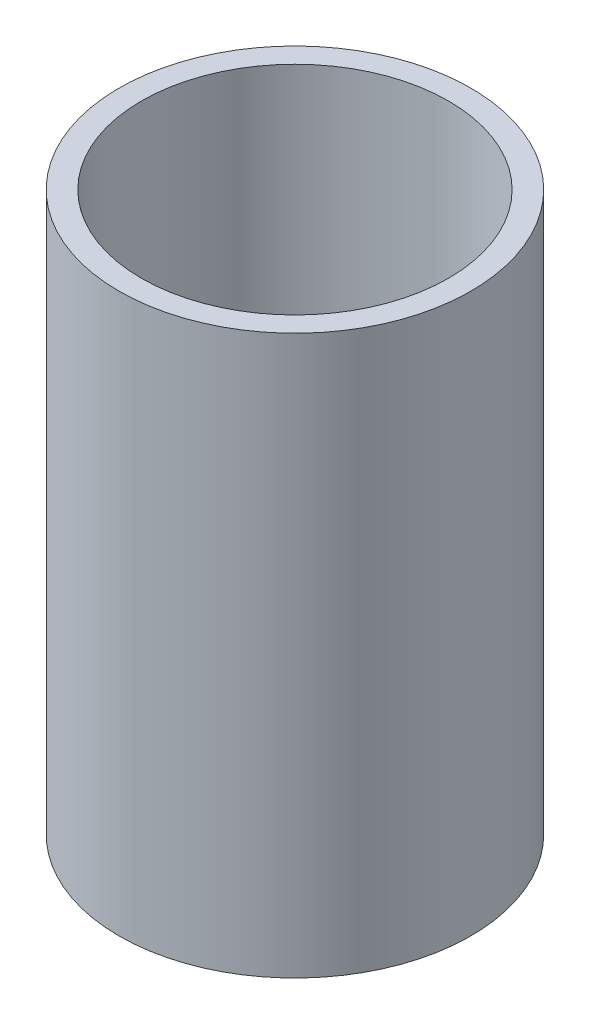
ISO-10303-21;
HEADER;
FILE_DESCRIPTION(('STEP AP214'),'2;1');
FILE_NAME('part.step','',(''),(''),'','','');
FILE_SCHEMA(('AUTOMOTIVE_DESIGN { 1 0 10303 214 1 1 1 1 }'));
ENDSEC;
DATA;
#1=APPLICATION_CONTEXT('core data for automotive mechanical design processes');
#2=APPLICATION_PROTOCOL_DEFINITION('international standard','automotive_design',2000,#1);
#3=PRODUCT_CONTEXT('',#1,'mechanical');
#4=PRODUCT('Part','Part','',(#3));
#5=PRODUCT_RELATED_PRODUCT_CATEGORY('part','',(#4));
#6=PRODUCT_DEFINITION_FORMATION('','',#4);
#7=PRODUCT_DEFINITION_CONTEXT('part definition',#1,'design');
#8=PRODUCT_DEFINITION('design','',#6,#7);
#9=PRODUCT_DEFINITION_SHAPE('','',#8);
#10=(LENGTH_UNIT() NAMED_UNIT(*) SI_UNIT(.MILLI.,.METRE.));
#11=(NAMED_UNIT(*) PLANE_ANGLE_UNIT() SI_UNIT($,.RADIAN.));
#12=(NAMED_UNIT(*) SI_UNIT($,.STERADIAN.) SOLID_ANGLE_UNIT());
#13=UNCERTAINTY_MEASURE_WITH_UNIT(LENGTH_MEASURE(1.E-05),#10,'distance_accuracy_value','');
#14=(GEOMETRIC_REPRESENTATION_CONTEXT(3) GLOBAL_UNCERTAINTY_ASSIGNED_CONTEXT((#13)) GLOBAL_UNIT_ASSIGNED_CONTEXT((#10,
#11,#12)) REPRESENTATION_CONTEXT('',''));
#15=CARTESIAN_POINT('',(0.,0.,0.));
#16=DIRECTION('',(0.,0.,1.));
#17=DIRECTION('',(1.,0.,0.));
#18=AXIS2_PLACEMENT_3D('',#15,#16,#17);
#19=CARTESIAN_POINT('',(0.,100.,0.));
#20=DIRECTION('',(0.,1.,0.));
#21=DIRECTION('',(0.,0.,1.));
#22=AXIS2_PLACEMENT_3D('',#19,#20,#21);
#23=PLANE('',#22);
#24=CARTESIAN_POINT('',(0.,100.,0.));
#25=DIRECTION('',(0.,1.,0.));
#26=DIRECTION('',(0.,0.,1.));
#27=AXIS2_PLACEMENT_3D('',#24,#25,#26);
#28=CIRCLE('',#27,31.5);
#29=CARTESIAN_POINT('',(0.,100.,31.5));
#30=VERTEX_POINT('',#29);
#31=EDGE_CURVE('E10',#30,#30,#28,.T.);
#32=ORIENTED_EDGE('',*,*,#31,.T.);
#33=EDGE_LOOP('',(#32));
#34=FACE_BOUND('',#33,.T.);
#35=CARTESIAN_POINT('',(0.,100.,0.));
#36=DIRECTION('',(0.,1.,0.));
#37=DIRECTION('',(0.,0.,1.));
#38=AXIS2_PLACEMENT_3D('',#35,#36,#37);
#39=CIRCLE('',#38,27.5);
#40=CARTESIAN_POINT('',(0.,100.,27.5));
#41=VERTEX_POINT('',#40);
#42=EDGE_CURVE('E42',#41,#41,#39,.T.);
#43=ORIENTED_EDGE('',*,*,#42,.F.);
#44=EDGE_LOOP('',(#43));
#45=FACE_BOUND('',#44,.T.);
#46=ADVANCED_FACE('F31',(#34,#45),#23,.T.);
#47=CARTESIAN_POINT('',(0.,0.,0.));
#48=DIRECTION('',(0.,1.,0.));
#49=DIRECTION('',(0.,0.,1.));
#50=AXIS2_PLACEMENT_3D('',#47,#48,#49);
#51=PLANE('',#50);
#52=CARTESIAN_POINT('',(0.,0.,0.));
#53=DIRECTION('',(0.,1.,0.));
#54=DIRECTION('',(0.,0.,1.));
#55=AXIS2_PLACEMENT_3D('',#52,#53,#54);
#56=CIRCLE('',#55,31.5);
#57=CARTESIAN_POINT('',(0.,0.,31.5));
#58=VERTEX_POINT('',#57);
#59=EDGE_CURVE('E35',#58,#58,#56,.T.);
#60=ORIENTED_EDGE('',*,*,#59,.F.);
#61=EDGE_LOOP('',(#60));
#62=FACE_BOUND('',#61,.T.);
#63=CARTESIAN_POINT('',(0.,0.,0.));
#64=DIRECTION('',(0.,1.,0.));
#65=DIRECTION('',(0.,0.,1.));
#66=AXIS2_PLACEMENT_3D('',#63,#64,#65);
#67=CIRCLE('',#66,27.5);
#68=CARTESIAN_POINT('',(0.,0.,27.5));
#69=VERTEX_POINT('',#68);
#70=EDGE_CURVE('E44',#69,#69,#67,.T.);
#71=ORIENTED_EDGE('',*,*,#70,.T.);
#72=EDGE_LOOP('',(#71));
#73=FACE_BOUND('',#72,.T.);
#74=ADVANCED_FACE('F54',(#62,#73),#51,.F.);
#75=CARTESIAN_POINT('',(0.,100.,0.));
#76=DIRECTION('',(0.,-1.,0.));
#77=DIRECTION('',(0.,0.,-1.));
#78=AXIS2_PLACEMENT_3D('',#75,#76,#77);
#79=CYLINDRICAL_SURFACE('',#78,31.5);
#80=ORIENTED_EDGE('',*,*,#31,.F.);
#81=EDGE_LOOP('',(#80));
#82=FACE_BOUND('',#81,.T.);
#83=ORIENTED_EDGE('',*,*,#59,.T.);
#84=EDGE_LOOP('',(#83));
#85=FACE_BOUND('',#84,.T.);
#86=ADVANCED_FACE('F33',(#82,#85),#79,.T.);
#87=CARTESIAN_POINT('',(0.,100.,0.));
#88=DIRECTION('',(0.,-1.,0.));
#89=DIRECTION('',(0.,0.,-1.));
#90=AXIS2_PLACEMENT_3D('',#87,#88,#89);
#91=CYLINDRICAL_SURFACE('',#90,27.5);
#92=ORIENTED_EDGE('',*,*,#42,.T.);
#93=EDGE_LOOP('',(#92));
#94=FACE_BOUND('',#93,.T.);
#95=ORIENTED_EDGE('',*,*,#70,.F.);
#96=EDGE_LOOP('',(#95));
#97=FACE_BOUND('',#96,.T.);
#98=ADVANCED_FACE('F50',(#94,#97),#91,.F.);
#99=CLOSED_SHELL('',(#46,#74,#86,#98));
#100=MANIFOLD_SOLID_BREP('B2',#99);
#101=ADVANCED_BREP_SHAPE_REPRESENTATION('',(#18,#100),#14);
#102=SHAPE_DEFINITION_REPRESENTATION(#9,#101);
ENDSEC;
END-ISO-10303-21;
